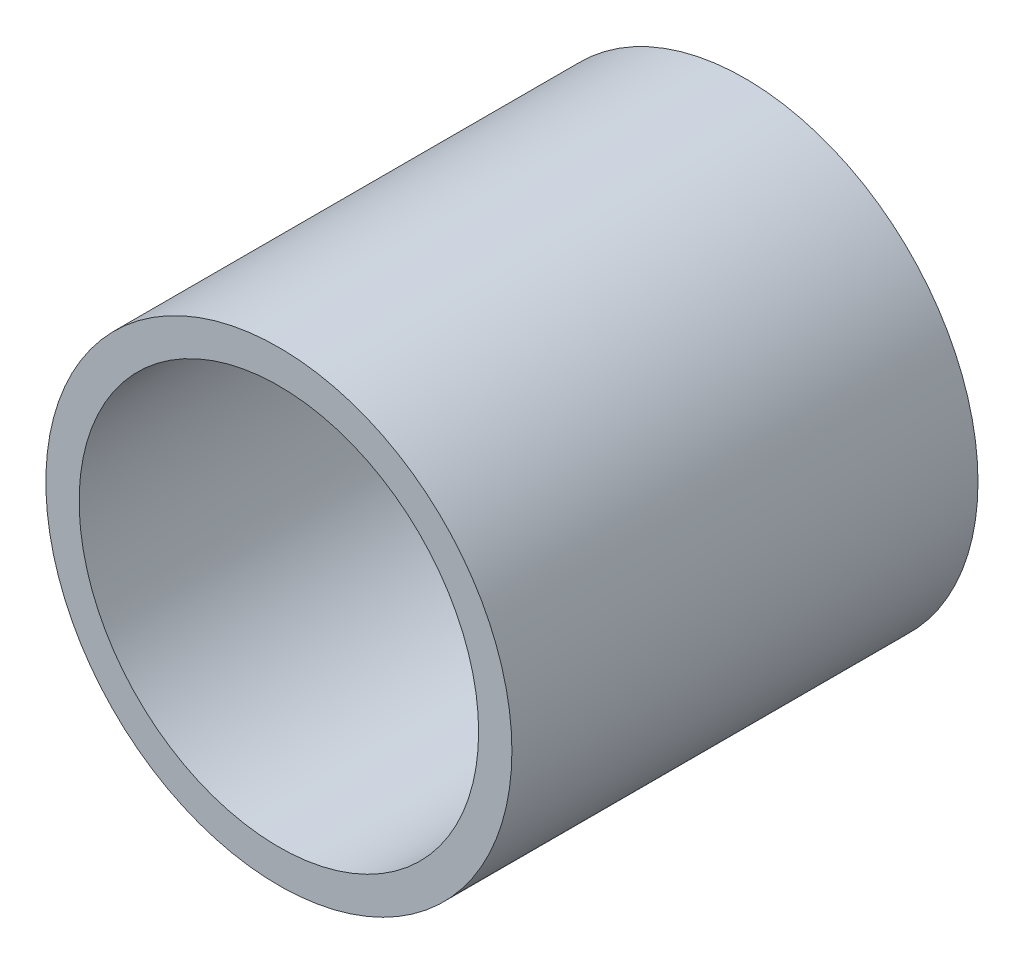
ISO-10303-21;
HEADER;
FILE_DESCRIPTION(('STEP AP214'),'2;1');
FILE_NAME('part.step','',(''),(''),'','','');
FILE_SCHEMA(('AUTOMOTIVE_DESIGN { 1 0 10303 214 1 1 1 1 }'));
ENDSEC;
DATA;
#1=APPLICATION_CONTEXT('core data for automotive mechanical design processes');
#2=APPLICATION_PROTOCOL_DEFINITION('international standard','automotive_design',2000,#1);
#3=PRODUCT_CONTEXT('',#1,'mechanical');
#4=PRODUCT('Part','Part','',(#3));
#5=PRODUCT_RELATED_PRODUCT_CATEGORY('part','',(#4));
#6=PRODUCT_DEFINITION_FORMATION('','',#4);
#7=PRODUCT_DEFINITION_CONTEXT('part definition',#1,'design');
#8=PRODUCT_DEFINITION('design','',#6,#7);
#9=PRODUCT_DEFINITION_SHAPE('','',#8);
#10=(LENGTH_UNIT() NAMED_UNIT(*) SI_UNIT(.MILLI.,.METRE.));
#11=(NAMED_UNIT(*) PLANE_ANGLE_UNIT() SI_UNIT($,.RADIAN.));
#12=(NAMED_UNIT(*) SI_UNIT($,.STERADIAN.) SOLID_ANGLE_UNIT());
#13=UNCERTAINTY_MEASURE_WITH_UNIT(LENGTH_MEASURE(1.E-05),#10,'distance_accuracy_value','');
#14=(GEOMETRIC_REPRESENTATION_CONTEXT(3) GLOBAL_UNCERTAINTY_ASSIGNED_CONTEXT((#13)) GLOBAL_UNIT_ASSIGNED_CONTEXT((#10,
#11,#12)) REPRESENTATION_CONTEXT('',''));
#15=CARTESIAN_POINT('',(0.,0.,0.));
#16=DIRECTION('',(0.,0.,1.));
#17=DIRECTION('',(1.,0.,0.));
#18=AXIS2_PLACEMENT_3D('',#15,#16,#17);
#19=CARTESIAN_POINT('',(0.,0.,28.));
#20=DIRECTION('',(0.,0.,1.));
#21=DIRECTION('',(1.,0.,0.));
#22=AXIS2_PLACEMENT_3D('',#19,#20,#21);
#23=PLANE('',#22);
#24=CARTESIAN_POINT('',(0.,0.,28.));
#25=DIRECTION('',(0.,0.,1.));
#26=DIRECTION('',(1.,0.,0.));
#27=AXIS2_PLACEMENT_3D('',#24,#25,#26);
#28=CIRCLE('',#27,14.);
#29=CARTESIAN_POINT('',(14.,0.,28.));
#30=VERTEX_POINT('',#29);
#31=EDGE_CURVE('E10',#30,#30,#28,.T.);
#32=ORIENTED_EDGE('',*,*,#31,.T.);
#33=EDGE_LOOP('',(#32));
#34=FACE_BOUND('',#33,.T.);
#35=CARTESIAN_POINT('',(0.,0.,28.));
#36=DIRECTION('',(0.,0.,1.));
#37=DIRECTION('',(1.,0.,0.));
#38=AXIS2_PLACEMENT_3D('',#35,#36,#37);
#39=CIRCLE('',#38,12.);
#40=CARTESIAN_POINT('',(12.,0.,28.));
#41=VERTEX_POINT('',#40);
#42=EDGE_CURVE('E41',#41,#41,#39,.T.);
#43=ORIENTED_EDGE('',*,*,#42,.F.);
#44=EDGE_LOOP('',(#43));
#45=FACE_BOUND('',#44,.T.);
#46=ADVANCED_FACE('F30',(#34,#45),#23,.T.);
#47=CARTESIAN_POINT('',(0.,0.,0.));
#48=DIRECTION('',(0.,0.,1.));
#49=DIRECTION('',(1.,0.,0.));
#50=AXIS2_PLACEMENT_3D('',#47,#48,#49);
#51=PLANE('',#50);
#52=CARTESIAN_POINT('',(0.,0.,0.));
#53=DIRECTION('',(0.,0.,1.));
#54=DIRECTION('',(1.,0.,0.));
#55=AXIS2_PLACEMENT_3D('',#52,#53,#54);
#56=CIRCLE('',#55,14.);
#57=CARTESIAN_POINT('',(14.,0.,0.));
#58=VERTEX_POINT('',#57);
#59=EDGE_CURVE('E34',#58,#58,#56,.T.);
#60=ORIENTED_EDGE('',*,*,#59,.F.);
#61=EDGE_LOOP('',(#60));
#62=FACE_BOUND('',#61,.T.);
#63=CARTESIAN_POINT('',(0.,0.,0.));
#64=DIRECTION('',(0.,0.,1.));
#65=DIRECTION('',(1.,0.,0.));
#66=AXIS2_PLACEMENT_3D('',#63,#64,#65);
#67=CIRCLE('',#66,12.);
#68=CARTESIAN_POINT('',(12.,0.,0.));
#69=VERTEX_POINT('',#68);
#70=EDGE_CURVE('E43',#69,#69,#67,.T.);
#71=ORIENTED_EDGE('',*,*,#70,.T.);
#72=EDGE_LOOP('',(#71));
#73=FACE_BOUND('',#72,.T.);
#74=ADVANCED_FACE('F53',(#62,#73),#51,.F.);
#75=CARTESIAN_POINT('',(0.,0.,28.));
#76=DIRECTION('',(0.,0.,-1.));
#77=DIRECTION('',(-1.,0.,0.));
#78=AXIS2_PLACEMENT_3D('',#75,#76,#77);
#79=CYLINDRICAL_SURFACE('',#78,14.);
#80=ORIENTED_EDGE('',*,*,#31,.F.);
#81=EDGE_LOOP('',(#80));
#82=FACE_BOUND('',#81,.T.);
#83=ORIENTED_EDGE('',*,*,#59,.T.);
#84=EDGE_LOOP('',(#83));
#85=FACE_BOUND('',#84,.T.);
#86=ADVANCED_FACE('F32',(#82,#85),#79,.T.);
#87=CARTESIAN_POINT('',(0.,0.,28.));
#88=DIRECTION('',(0.,0.,-1.));
#89=DIRECTION('',(-1.,0.,0.));
#90=AXIS2_PLACEMENT_3D('',#87,#88,#89);
#91=CYLINDRICAL_SURFACE('',#90,12.);
#92=ORIENTED_EDGE('',*,*,#42,.T.);
#93=EDGE_LOOP('',(#92));
#94=FACE_BOUND('',#93,.T.);
#95=ORIENTED_EDGE('',*,*,#70,.F.);
#96=EDGE_LOOP('',(#95));
#97=FACE_BOUND('',#96,.T.);
#98=ADVANCED_FACE('F49',(#94,#97),#91,.F.);
#99=CLOSED_SHELL('',(#46,#74,#86,#98));
#100=MANIFOLD_SOLID_BREP('B2',#99);
#101=ADVANCED_BREP_SHAPE_REPRESENTATION('',(#18,#100),#14);
#102=SHAPE_DEFINITION_REPRESENTATION(#9,#101);
ENDSEC;
END-ISO-10303-21;
